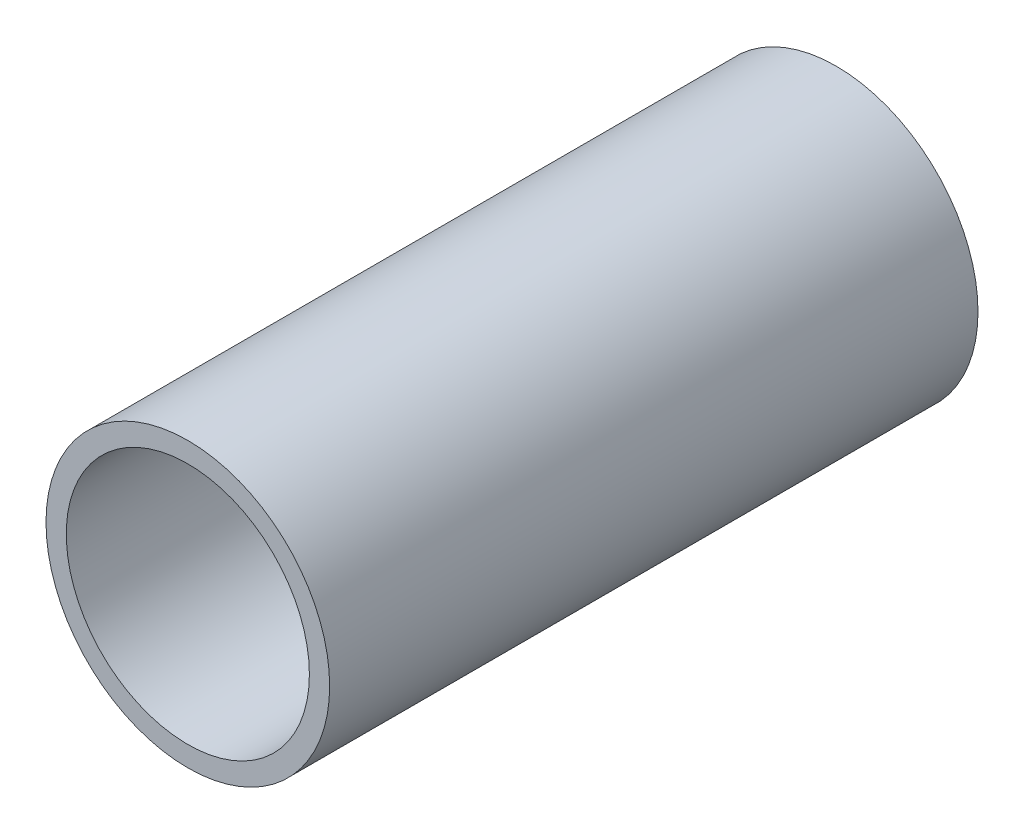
ISO-10303-21;
HEADER;
FILE_DESCRIPTION(('STEP AP214'),'2;1');
FILE_NAME('part.step','',(''),(''),'','','');
FILE_SCHEMA(('AUTOMOTIVE_DESIGN { 1 0 10303 214 1 1 1 1 }'));
ENDSEC;
DATA;
#1=APPLICATION_CONTEXT('core data for automotive mechanical design processes');
#2=APPLICATION_PROTOCOL_DEFINITION('international standard','automotive_design',2000,#1);
#3=PRODUCT_CONTEXT('',#1,'mechanical');
#4=PRODUCT('Part','Part','',(#3));
#5=PRODUCT_RELATED_PRODUCT_CATEGORY('part','',(#4));
#6=PRODUCT_DEFINITION_FORMATION('','',#4);
#7=PRODUCT_DEFINITION_CONTEXT('part definition',#1,'design');
#8=PRODUCT_DEFINITION('design','',#6,#7);
#9=PRODUCT_DEFINITION_SHAPE('','',#8);
#10=(LENGTH_UNIT() NAMED_UNIT(*) SI_UNIT(.MILLI.,.METRE.));
#11=(NAMED_UNIT(*) PLANE_ANGLE_UNIT() SI_UNIT($,.RADIAN.));
#12=(NAMED_UNIT(*) SI_UNIT($,.STERADIAN.) SOLID_ANGLE_UNIT());
#13=UNCERTAINTY_MEASURE_WITH_UNIT(LENGTH_MEASURE(1.E-05),#10,'distance_accuracy_value','');
#14=(GEOMETRIC_REPRESENTATION_CONTEXT(3) GLOBAL_UNCERTAINTY_ASSIGNED_CONTEXT((#13)) GLOBAL_UNIT_ASSIGNED_CONTEXT((#10,
#11,#12)) REPRESENTATION_CONTEXT('',''));
#15=CARTESIAN_POINT('',(0.,0.,0.));
#16=DIRECTION('',(0.,0.,1.));
#17=DIRECTION('',(1.,0.,0.));
#18=AXIS2_PLACEMENT_3D('',#15,#16,#17);
#19=CARTESIAN_POINT('',(0.,0.,203.2));
#20=DIRECTION('',(0.,0.,1.));
#21=DIRECTION('',(1.,0.,0.));
#22=AXIS2_PLACEMENT_3D('',#19,#20,#21);
#23=PLANE('',#22);
#24=CARTESIAN_POINT('',(0.,0.,203.2));
#25=DIRECTION('',(0.,0.,1.));
#26=DIRECTION('',(1.,0.,0.));
#27=AXIS2_PLACEMENT_3D('',#24,#25,#26);
#28=CIRCLE('',#27,44.45);
#29=CARTESIAN_POINT('',(44.45,0.,203.2));
#30=VERTEX_POINT('',#29);
#31=EDGE_CURVE('E10',#30,#30,#28,.T.);
#32=ORIENTED_EDGE('',*,*,#31,.T.);
#33=EDGE_LOOP('',(#32));
#34=FACE_BOUND('',#33,.T.);
#35=CARTESIAN_POINT('',(0.,0.,203.2));
#36=DIRECTION('',(0.,0.,1.));
#37=DIRECTION('',(1.,0.,0.));
#38=AXIS2_PLACEMENT_3D('',#35,#36,#37);
#39=CIRCLE('',#38,38.1);
#40=CARTESIAN_POINT('',(38.1,0.,203.2));
#41=VERTEX_POINT('',#40);
#42=EDGE_CURVE('E43',#41,#41,#39,.T.);
#43=ORIENTED_EDGE('',*,*,#42,.F.);
#44=EDGE_LOOP('',(#43));
#45=FACE_BOUND('',#44,.T.);
#46=ADVANCED_FACE('F32',(#34,#45),#23,.T.);
#47=CARTESIAN_POINT('',(0.,0.,0.));
#48=DIRECTION('',(0.,0.,1.));
#49=DIRECTION('',(1.,0.,0.));
#50=AXIS2_PLACEMENT_3D('',#47,#48,#49);
#51=PLANE('',#50);
#52=CARTESIAN_POINT('',(0.,0.,0.));
#53=DIRECTION('',(0.,0.,1.));
#54=DIRECTION('',(1.,0.,0.));
#55=AXIS2_PLACEMENT_3D('',#52,#53,#54);
#56=CIRCLE('',#55,44.45);
#57=CARTESIAN_POINT('',(44.45,0.,0.));
#58=VERTEX_POINT('',#57);
#59=EDGE_CURVE('E36',#58,#58,#56,.T.);
#60=ORIENTED_EDGE('',*,*,#59,.F.);
#61=EDGE_LOOP('',(#60));
#62=FACE_BOUND('',#61,.T.);
#63=CARTESIAN_POINT('',(0.,0.,0.));
#64=DIRECTION('',(0.,0.,1.));
#65=DIRECTION('',(1.,0.,0.));
#66=AXIS2_PLACEMENT_3D('',#63,#64,#65);
#67=CIRCLE('',#66,38.1);
#68=CARTESIAN_POINT('',(38.1,0.,0.));
#69=VERTEX_POINT('',#68);
#70=EDGE_CURVE('E45',#69,#69,#67,.T.);
#71=ORIENTED_EDGE('',*,*,#70,.T.);
#72=EDGE_LOOP('',(#71));
#73=FACE_BOUND('',#72,.T.);
#74=ADVANCED_FACE('F55',(#62,#73),#51,.F.);
#75=CARTESIAN_POINT('',(0.,0.,203.2));
#76=DIRECTION('',(0.,0.,-1.));
#77=DIRECTION('',(-1.,0.,0.));
#78=AXIS2_PLACEMENT_3D('',#75,#76,#77);
#79=CYLINDRICAL_SURFACE('',#78,44.45);
#80=ORIENTED_EDGE('',*,*,#31,.F.);
#81=EDGE_LOOP('',(#80));
#82=FACE_BOUND('',#81,.T.);
#83=ORIENTED_EDGE('',*,*,#59,.T.);
#84=EDGE_LOOP('',(#83));
#85=FACE_BOUND('',#84,.T.);
#86=ADVANCED_FACE('F34',(#82,#85),#79,.T.);
#87=CARTESIAN_POINT('',(0.,0.,203.2));
#88=DIRECTION('',(0.,0.,-1.));
#89=DIRECTION('',(-1.,0.,0.));
#90=AXIS2_PLACEMENT_3D('',#87,#88,#89);
#91=CYLINDRICAL_SURFACE('',#90,38.1);
#92=ORIENTED_EDGE('',*,*,#42,.T.);
#93=EDGE_LOOP('',(#92));
#94=FACE_BOUND('',#93,.T.);
#95=ORIENTED_EDGE('',*,*,#70,.F.);
#96=EDGE_LOOP('',(#95));
#97=FACE_BOUND('',#96,.T.);
#98=ADVANCED_FACE('F51',(#94,#97),#91,.F.);
#99=CLOSED_SHELL('',(#46,#74,#86,#98));
#100=MANIFOLD_SOLID_BREP('B2',#99);
#101=ADVANCED_BREP_SHAPE_REPRESENTATION('',(#18,#100),#14);
#102=SHAPE_DEFINITION_REPRESENTATION(#9,#101);
ENDSEC;
END-ISO-10303-21;
